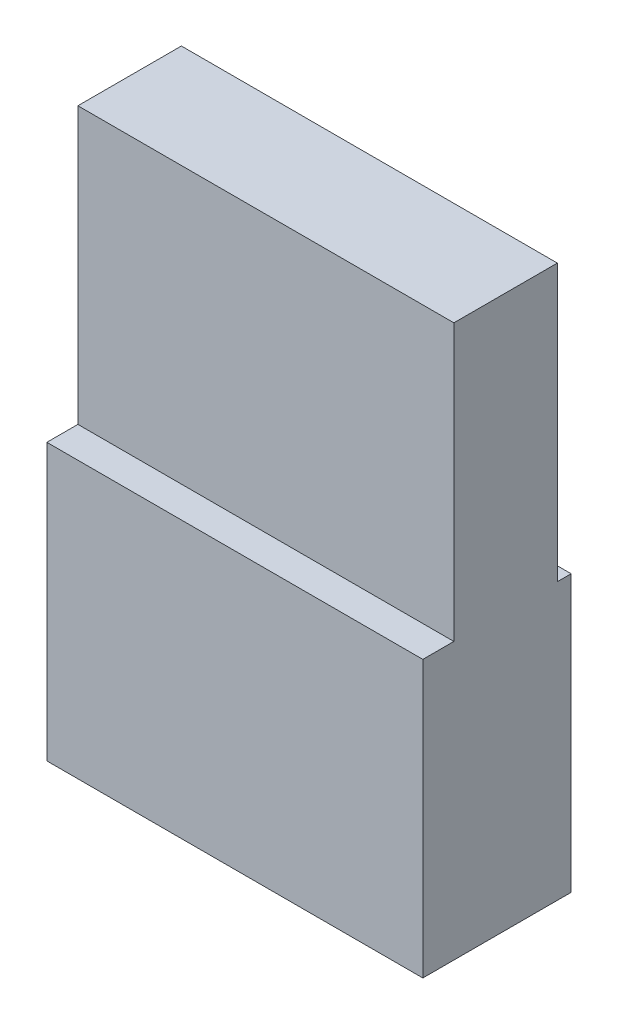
ISO-10303-21;
HEADER;
FILE_DESCRIPTION(('STEP AP214'),'2;1');
FILE_NAME('part.step','',(''),(''),'','','');
FILE_SCHEMA(('AUTOMOTIVE_DESIGN { 1 0 10303 214 1 1 1 1 }'));
ENDSEC;
DATA;
#1=APPLICATION_CONTEXT('core data for automotive mechanical design processes');
#2=APPLICATION_PROTOCOL_DEFINITION('international standard','automotive_design',2000,#1);
#3=PRODUCT_CONTEXT('',#1,'mechanical');
#4=PRODUCT('Part','Part','',(#3));
#5=PRODUCT_RELATED_PRODUCT_CATEGORY('part','',(#4));
#6=PRODUCT_DEFINITION_FORMATION('','',#4);
#7=PRODUCT_DEFINITION_CONTEXT('part definition',#1,'design');
#8=PRODUCT_DEFINITION('design','',#6,#7);
#9=PRODUCT_DEFINITION_SHAPE('','',#8);
#10=(LENGTH_UNIT() NAMED_UNIT(*) SI_UNIT(.MILLI.,.METRE.));
#11=(NAMED_UNIT(*) PLANE_ANGLE_UNIT() SI_UNIT($,.RADIAN.));
#12=(NAMED_UNIT(*) SI_UNIT($,.STERADIAN.) SOLID_ANGLE_UNIT());
#13=UNCERTAINTY_MEASURE_WITH_UNIT(LENGTH_MEASURE(1.E-05),#10,'distance_accuracy_value','');
#14=(GEOMETRIC_REPRESENTATION_CONTEXT(3) GLOBAL_UNCERTAINTY_ASSIGNED_CONTEXT((#13)) GLOBAL_UNIT_ASSIGNED_CONTEXT((#10,
#11,#12)) REPRESENTATION_CONTEXT('',''));
#15=CARTESIAN_POINT('',(0.,0.,0.));
#16=DIRECTION('',(0.,0.,1.));
#17=DIRECTION('',(1.,0.,0.));
#18=AXIS2_PLACEMENT_3D('',#15,#16,#17);
#19=CARTESIAN_POINT('',(0.,4.,0.));
#20=DIRECTION('',(0.,1.,0.));
#21=DIRECTION('',(0.,0.,1.));
#22=AXIS2_PLACEMENT_3D('',#19,#20,#21);
#23=PLANE('',#22);
#24=DIRECTION('',(-1.,0.,0.));
#25=VECTOR('',#24,1.);
#26=CARTESIAN_POINT('',(2.72500000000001,4.,-0.874999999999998));
#27=LINE('',#26,#25);
#28=CARTESIAN_POINT('',(2.72499999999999,4.,-0.874999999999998));
#29=VERTEX_POINT('',#28);
#30=CARTESIAN_POINT('',(-2.72500000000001,4.,-0.874999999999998));
#31=VERTEX_POINT('',#30);
#32=EDGE_CURVE('E119',#29,#31,#27,.T.);
#33=ORIENTED_EDGE('',*,*,#32,.F.);
#34=DIRECTION('',(0.,0.,-1.));
#35=VECTOR('',#34,1.);
#36=CARTESIAN_POINT('',(2.72499999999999,4.,-1.075));
#37=LINE('',#36,#35);
#38=CARTESIAN_POINT('',(2.72499999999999,4.,-1.075));
#39=VERTEX_POINT('',#38);
#40=EDGE_CURVE('E151',#29,#39,#37,.T.);
#41=ORIENTED_EDGE('',*,*,#40,.T.);
#42=DIRECTION('',(-1.,0.,0.));
#43=VECTOR('',#42,1.);
#44=CARTESIAN_POINT('',(-2.72500000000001,4.,-1.075));
#45=LINE('',#44,#43);
#46=CARTESIAN_POINT('',(-2.72500000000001,4.,-1.075));
#47=VERTEX_POINT('',#46);
#48=EDGE_CURVE('E147',#39,#47,#45,.T.);
#49=ORIENTED_EDGE('',*,*,#48,.T.);
#50=DIRECTION('',(0.,0.,1.));
#51=VECTOR('',#50,1.);
#52=CARTESIAN_POINT('',(-2.72500000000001,4.,-1.075));
#53=LINE('',#52,#51);
#54=EDGE_CURVE('E58',#47,#31,#53,.T.);
#55=ORIENTED_EDGE('',*,*,#54,.T.);
#56=EDGE_LOOP('',(#33,#41,#49,#55));
#57=FACE_BOUND('',#56,.T.);
#58=ADVANCED_FACE('F33',(#57),#23,.T.);
#59=CARTESIAN_POINT('',(2.72499999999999,4.,-1.075));
#60=DIRECTION('',(-1.,0.,0.));
#61=DIRECTION('',(0.,0.,1.));
#62=AXIS2_PLACEMENT_3D('',#59,#60,#61);
#63=PLANE('',#62);
#64=DIRECTION('',(0.,0.,-1.));
#65=VECTOR('',#64,1.);
#66=CARTESIAN_POINT('',(2.72499999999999,0.,-1.075));
#67=LINE('',#66,#65);
#68=CARTESIAN_POINT('',(2.72499999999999,0.,1.075));
#69=VERTEX_POINT('',#68);
#70=CARTESIAN_POINT('',(2.72499999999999,0.,-1.075));
#71=VERTEX_POINT('',#70);
#72=EDGE_CURVE('E124',#69,#71,#67,.T.);
#73=ORIENTED_EDGE('',*,*,#72,.T.);
#74=DIRECTION('',(0.,-1.,0.));
#75=VECTOR('',#74,1.);
#76=CARTESIAN_POINT('',(2.72499999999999,4.,-1.075));
#77=LINE('',#76,#75);
#78=EDGE_CURVE('E11',#39,#71,#77,.T.);
#79=ORIENTED_EDGE('',*,*,#78,.F.);
#80=ORIENTED_EDGE('',*,*,#40,.F.);
#81=DIRECTION('',(0.,-1.,0.));
#82=VECTOR('',#81,1.);
#83=CARTESIAN_POINT('',(2.72500000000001,8.,-0.874999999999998));
#84=LINE('',#83,#82);
#85=CARTESIAN_POINT('',(2.72500000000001,8.,-0.874999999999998));
#86=VERTEX_POINT('',#85);
#87=EDGE_CURVE('E129',#86,#29,#84,.T.);
#88=ORIENTED_EDGE('',*,*,#87,.F.);
#89=DIRECTION('',(0.,0.,-1.));
#90=VECTOR('',#89,1.);
#91=CARTESIAN_POINT('',(2.72500000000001,8.,-0.874999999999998));
#92=LINE('',#91,#90);
#93=CARTESIAN_POINT('',(2.72500000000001,8.,0.625000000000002));
#94=VERTEX_POINT('',#93);
#95=EDGE_CURVE('E109',#94,#86,#92,.T.);
#96=ORIENTED_EDGE('',*,*,#95,.F.);
#97=DIRECTION('',(0.,-1.,0.));
#98=VECTOR('',#97,1.);
#99=CARTESIAN_POINT('',(2.72500000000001,8.,0.625000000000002));
#100=LINE('',#99,#98);
#101=CARTESIAN_POINT('',(2.72500000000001,4.,0.625000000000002));
#102=VERTEX_POINT('',#101);
#103=EDGE_CURVE('E106',#94,#102,#100,.T.);
#104=ORIENTED_EDGE('',*,*,#103,.T.);
#105=CARTESIAN_POINT('',(2.72499999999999,4.,1.075));
#106=VERTEX_POINT('',#105);
#107=EDGE_CURVE('E154',#106,#102,#37,.T.);
#108=ORIENTED_EDGE('',*,*,#107,.F.);
#109=DIRECTION('',(0.,-1.,0.));
#110=VECTOR('',#109,1.);
#111=CARTESIAN_POINT('',(2.72499999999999,4.,1.075));
#112=LINE('',#111,#110);
#113=EDGE_CURVE('E161',#106,#69,#112,.T.);
#114=ORIENTED_EDGE('',*,*,#113,.T.);
#115=EDGE_LOOP('',(#73,#79,#80,#88,#96,#104,#108,#114));
#116=FACE_BOUND('',#115,.T.);
#117=ADVANCED_FACE('F35',(#116),#63,.F.);
#118=CARTESIAN_POINT('',(-2.72500000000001,4.,-1.075));
#119=DIRECTION('',(0.,0.,1.));
#120=DIRECTION('',(1.,0.,0.));
#121=AXIS2_PLACEMENT_3D('',#118,#119,#120);
#122=PLANE('',#121);
#123=DIRECTION('',(-1.,0.,0.));
#124=VECTOR('',#123,1.);
#125=CARTESIAN_POINT('',(-2.72500000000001,0.,-1.075));
#126=LINE('',#125,#124);
#127=CARTESIAN_POINT('',(-2.72500000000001,0.,-1.075));
#128=VERTEX_POINT('',#127);
#129=EDGE_CURVE('E127',#71,#128,#126,.T.);
#130=ORIENTED_EDGE('',*,*,#129,.T.);
#131=DIRECTION('',(0.,-1.,0.));
#132=VECTOR('',#131,1.);
#133=CARTESIAN_POINT('',(-2.72500000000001,4.,-1.075));
#134=LINE('',#133,#132);
#135=EDGE_CURVE('E42',#47,#128,#134,.T.);
#136=ORIENTED_EDGE('',*,*,#135,.F.);
#137=ORIENTED_EDGE('',*,*,#48,.F.);
#138=ORIENTED_EDGE('',*,*,#78,.T.);
#139=EDGE_LOOP('',(#130,#136,#137,#138));
#140=FACE_BOUND('',#139,.T.);
#141=ADVANCED_FACE('F179',(#140),#122,.F.);
#142=CARTESIAN_POINT('',(-2.72500000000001,4.,-1.075));
#143=DIRECTION('',(1.,0.,0.));
#144=DIRECTION('',(0.,0.,-1.));
#145=AXIS2_PLACEMENT_3D('',#142,#143,#144);
#146=PLANE('',#145);
#147=DIRECTION('',(0.,0.,1.));
#148=VECTOR('',#147,1.);
#149=CARTESIAN_POINT('',(-2.72500000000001,0.,-1.075));
#150=LINE('',#149,#148);
#151=CARTESIAN_POINT('',(-2.72500000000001,0.,1.075));
#152=VERTEX_POINT('',#151);
#153=EDGE_CURVE('E167',#128,#152,#150,.T.);
#154=ORIENTED_EDGE('',*,*,#153,.T.);
#155=DIRECTION('',(0.,-1.,0.));
#156=VECTOR('',#155,1.);
#157=CARTESIAN_POINT('',(-2.72500000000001,4.,1.075));
#158=LINE('',#157,#156);
#159=CARTESIAN_POINT('',(-2.72500000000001,4.,1.075));
#160=VERTEX_POINT('',#159);
#161=EDGE_CURVE('E158',#160,#152,#158,.T.);
#162=ORIENTED_EDGE('',*,*,#161,.F.);
#163=CARTESIAN_POINT('',(-2.72500000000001,4.,0.625000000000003));
#164=VERTEX_POINT('',#163);
#165=EDGE_CURVE('E123',#164,#160,#53,.T.);
#166=ORIENTED_EDGE('',*,*,#165,.F.);
#167=DIRECTION('',(0.,-1.,0.));
#168=VECTOR('',#167,1.);
#169=CARTESIAN_POINT('',(-2.72500000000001,8.,0.625000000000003));
#170=LINE('',#169,#168);
#171=CARTESIAN_POINT('',(-2.72500000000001,8.,0.625000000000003));
#172=VERTEX_POINT('',#171);
#173=EDGE_CURVE('E104',#172,#164,#170,.T.);
#174=ORIENTED_EDGE('',*,*,#173,.F.);
#175=DIRECTION('',(0.,0.,1.));
#176=VECTOR('',#175,1.);
#177=CARTESIAN_POINT('',(-2.72500000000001,8.,-0.874999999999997));
#178=LINE('',#177,#176);
#179=CARTESIAN_POINT('',(-2.72500000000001,8.,-0.874999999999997));
#180=VERTEX_POINT('',#179);
#181=EDGE_CURVE('E110',#180,#172,#178,.T.);
#182=ORIENTED_EDGE('',*,*,#181,.F.);
#183=DIRECTION('',(0.,-1.,0.));
#184=VECTOR('',#183,1.);
#185=CARTESIAN_POINT('',(-2.72500000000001,8.,-0.874999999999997));
#186=LINE('',#185,#184);
#187=EDGE_CURVE('E138',#180,#31,#186,.T.);
#188=ORIENTED_EDGE('',*,*,#187,.T.);
#189=ORIENTED_EDGE('',*,*,#54,.F.);
#190=ORIENTED_EDGE('',*,*,#135,.T.);
#191=EDGE_LOOP('',(#154,#162,#166,#174,#182,#188,#189,#190));
#192=FACE_BOUND('',#191,.T.);
#193=ADVANCED_FACE('F121',(#192),#146,.F.);
#194=CARTESIAN_POINT('',(-2.72500000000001,4.,1.075));
#195=DIRECTION('',(0.,0.,-1.));
#196=DIRECTION('',(-1.,0.,0.));
#197=AXIS2_PLACEMENT_3D('',#194,#195,#196);
#198=PLANE('',#197);
#199=DIRECTION('',(1.,0.,0.));
#200=VECTOR('',#199,1.);
#201=CARTESIAN_POINT('',(-2.72500000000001,0.,1.075));
#202=LINE('',#201,#200);
#203=EDGE_CURVE('E165',#152,#69,#202,.T.);
#204=ORIENTED_EDGE('',*,*,#203,.T.);
#205=ORIENTED_EDGE('',*,*,#113,.F.);
#206=DIRECTION('',(1.,0.,0.));
#207=VECTOR('',#206,1.);
#208=CARTESIAN_POINT('',(-2.72500000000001,4.,1.075));
#209=LINE('',#208,#207);
#210=EDGE_CURVE('E164',#160,#106,#209,.T.);
#211=ORIENTED_EDGE('',*,*,#210,.F.);
#212=ORIENTED_EDGE('',*,*,#161,.T.);
#213=EDGE_LOOP('',(#204,#205,#211,#212));
#214=FACE_BOUND('',#213,.T.);
#215=ADVANCED_FACE('F204',(#214),#198,.F.);
#216=DIRECTION('',(1.,0.,0.));
#217=VECTOR('',#216,1.);
#218=CARTESIAN_POINT('',(2.72500000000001,4.,0.625000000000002));
#219=LINE('',#218,#217);
#220=EDGE_CURVE('E50',#164,#102,#219,.T.);
#221=ORIENTED_EDGE('',*,*,#220,.F.);
#222=ORIENTED_EDGE('',*,*,#165,.T.);
#223=ORIENTED_EDGE('',*,*,#210,.T.);
#224=ORIENTED_EDGE('',*,*,#107,.T.);
#225=EDGE_LOOP('',(#221,#222,#223,#224));
#226=FACE_BOUND('',#225,.T.);
#227=ADVANCED_FACE('F198',(#226),#23,.T.);
#228=CARTESIAN_POINT('',(0.,0.,0.));
#229=DIRECTION('',(0.,1.,0.));
#230=DIRECTION('',(0.,0.,1.));
#231=AXIS2_PLACEMENT_3D('',#228,#229,#230);
#232=PLANE('',#231);
#233=ORIENTED_EDGE('',*,*,#72,.F.);
#234=ORIENTED_EDGE('',*,*,#203,.F.);
#235=ORIENTED_EDGE('',*,*,#153,.F.);
#236=ORIENTED_EDGE('',*,*,#129,.F.);
#237=EDGE_LOOP('',(#233,#234,#235,#236));
#238=FACE_BOUND('',#237,.T.);
#239=ADVANCED_FACE('F194',(#238),#232,.F.);
#240=CARTESIAN_POINT('',(2.72500000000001,8.,0.625000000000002));
#241=DIRECTION('',(0.,0.,-1.));
#242=DIRECTION('',(-1.,0.,0.));
#243=AXIS2_PLACEMENT_3D('',#240,#241,#242);
#244=PLANE('',#243);
#245=ORIENTED_EDGE('',*,*,#220,.T.);
#246=ORIENTED_EDGE('',*,*,#103,.F.);
#247=DIRECTION('',(1.,0.,0.));
#248=VECTOR('',#247,1.);
#249=CARTESIAN_POINT('',(2.72500000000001,8.,0.625000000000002));
#250=LINE('',#249,#248);
#251=EDGE_CURVE('E100',#172,#94,#250,.T.);
#252=ORIENTED_EDGE('',*,*,#251,.F.);
#253=ORIENTED_EDGE('',*,*,#173,.T.);
#254=EDGE_LOOP('',(#245,#246,#252,#253));
#255=FACE_BOUND('',#254,.T.);
#256=ADVANCED_FACE('F102',(#255),#244,.F.);
#257=CARTESIAN_POINT('',(2.72500000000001,8.,-0.874999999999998));
#258=DIRECTION('',(0.,0.,1.));
#259=DIRECTION('',(1.,0.,0.));
#260=AXIS2_PLACEMENT_3D('',#257,#258,#259);
#261=PLANE('',#260);
#262=ORIENTED_EDGE('',*,*,#32,.T.);
#263=ORIENTED_EDGE('',*,*,#187,.F.);
#264=DIRECTION('',(-1.,0.,0.));
#265=VECTOR('',#264,1.);
#266=CARTESIAN_POINT('',(2.72500000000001,8.,-0.874999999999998));
#267=LINE('',#266,#265);
#268=EDGE_CURVE('E115',#86,#180,#267,.T.);
#269=ORIENTED_EDGE('',*,*,#268,.F.);
#270=ORIENTED_EDGE('',*,*,#87,.T.);
#271=EDGE_LOOP('',(#262,#263,#269,#270));
#272=FACE_BOUND('',#271,.T.);
#273=ADVANCED_FACE('F186',(#272),#261,.F.);
#274=CARTESIAN_POINT('',(0.,8.,0.));
#275=DIRECTION('',(0.,-1.,0.));
#276=DIRECTION('',(0.,0.,-1.));
#277=AXIS2_PLACEMENT_3D('',#274,#275,#276);
#278=PLANE('',#277);
#279=ORIENTED_EDGE('',*,*,#181,.T.);
#280=ORIENTED_EDGE('',*,*,#251,.T.);
#281=ORIENTED_EDGE('',*,*,#95,.T.);
#282=ORIENTED_EDGE('',*,*,#268,.T.);
#283=EDGE_LOOP('',(#279,#280,#281,#282));
#284=FACE_BOUND('',#283,.T.);
#285=ADVANCED_FACE('F113',(#284),#278,.F.);
#286=CLOSED_SHELL('',(#58,#117,#141,#193,#215,#227,#239,#256,#273,#285));
#287=MANIFOLD_SOLID_BREP('B2',#286);
#288=ADVANCED_BREP_SHAPE_REPRESENTATION('',(#18,#287),#14);
#289=SHAPE_DEFINITION_REPRESENTATION(#9,#288);
ENDSEC;
END-ISO-10303-21;
